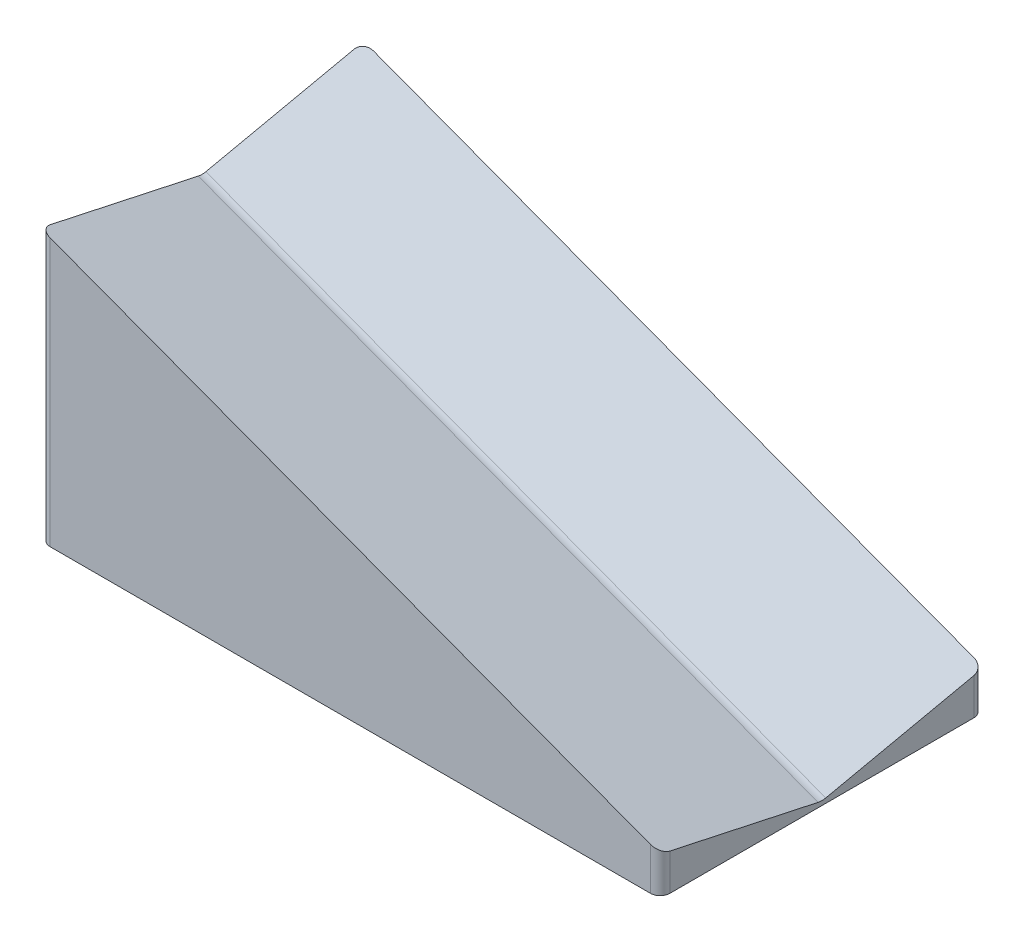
from build123d import *

# Parameters (mm, degrees)
EXTRUDE_2_DEPTH = 41.75
FILLET_1_R      = 2.5
FILLET_2_R      = 5


with BuildPart() as part:
    # Sketch 1 → Extrude 2 (new, symmetric)
    with BuildSketch(Plane.XY):
        Polygon((0, 70), (0, 0), (160, 0), (160, 10), align=None)
    extrude(amount=EXTRUDE_2_DEPTH, both=True)

    # Sketch 3 → Loft 1 section 0
    with BuildSketch(Plane.ZY):
        with BuildLine():
            Line((-41.75, 70), (0, 61))
            Line((0, 61), (41.75, 70))
            Line((41.75, 70), (-41.75, 70))
        make_face()
    # Sketch 2 → Loft 1 section 1
    with BuildSketch(Plane(origin=(160, 0, 0), x_dir=(0, 0, -1), z_dir=(1, 0, 0))):
        with BuildLine():
            Line((41.75, 10), (0, 1))
            Line((0, 1), (-41.75, 10))
            Line((-41.75, 10), (41.75, 10))
        make_face()
    loft(mode=Mode.SUBTRACT)

    # Fillet 1
    fillet_1_edges = [part.edges().sort_by_distance(p)[0] for p in [
        (0, 35, -41.75),
        (160, 5, -41.75),
        (160, 5, 41.75),
        (0, 35, 41.75),
    ]]
    fillet(fillet_1_edges, radius=FILLET_1_R)

    # Fillet 2
    fillet_2_edges = [part.edges().sort_by_distance(p)[0] for p in [
        (80, 31, 0),
    ]]
    fillet(fillet_2_edges, radius=FILLET_2_R)


solid = part.part
